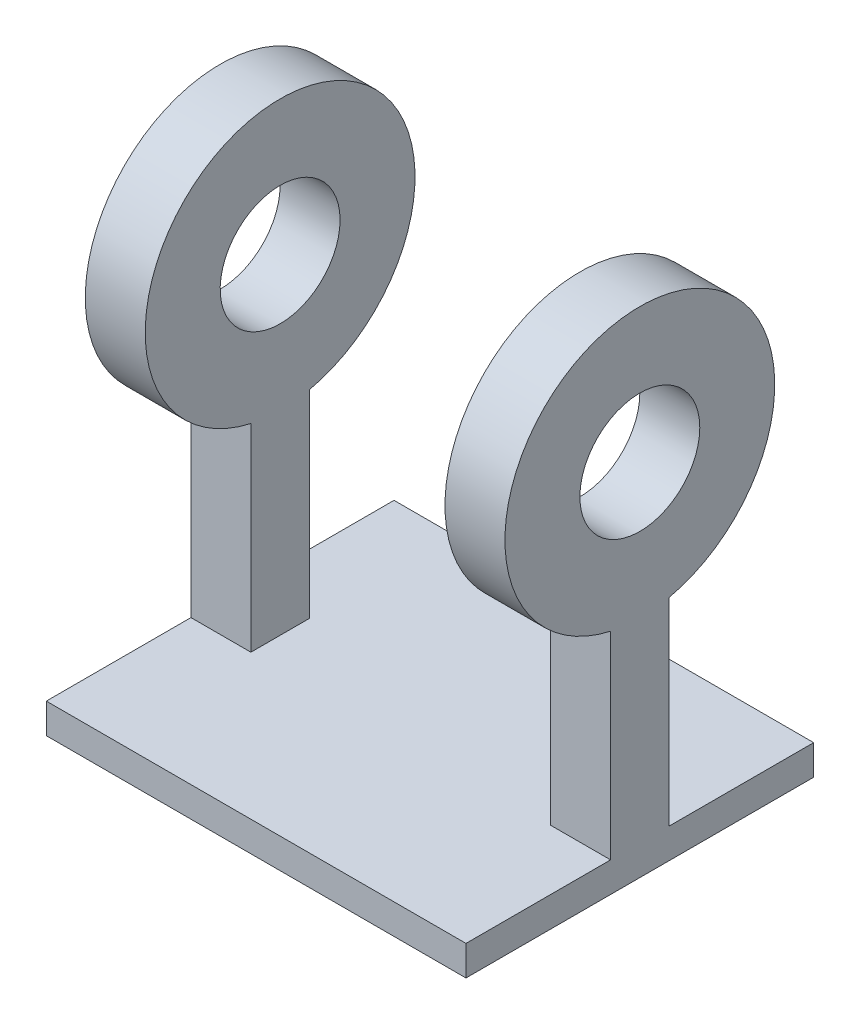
ISO-10303-21;
HEADER;
FILE_DESCRIPTION(('STEP AP214'),'2;1');
FILE_NAME('part.step','',(''),(''),'','','');
FILE_SCHEMA(('AUTOMOTIVE_DESIGN { 1 0 10303 214 1 1 1 1 }'));
ENDSEC;
DATA;
#1=APPLICATION_CONTEXT('core data for automotive mechanical design processes');
#2=APPLICATION_PROTOCOL_DEFINITION('international standard','automotive_design',2000,#1);
#3=PRODUCT_CONTEXT('',#1,'mechanical');
#4=PRODUCT('Part','Part','',(#3));
#5=PRODUCT_RELATED_PRODUCT_CATEGORY('part','',(#4));
#6=PRODUCT_DEFINITION_FORMATION('','',#4);
#7=PRODUCT_DEFINITION_CONTEXT('part definition',#1,'design');
#8=PRODUCT_DEFINITION('design','',#6,#7);
#9=PRODUCT_DEFINITION_SHAPE('','',#8);
#10=(LENGTH_UNIT() NAMED_UNIT(*) SI_UNIT(.MILLI.,.METRE.));
#11=(NAMED_UNIT(*) PLANE_ANGLE_UNIT() SI_UNIT($,.RADIAN.));
#12=(NAMED_UNIT(*) SI_UNIT($,.STERADIAN.) SOLID_ANGLE_UNIT());
#13=UNCERTAINTY_MEASURE_WITH_UNIT(LENGTH_MEASURE(1.E-05),#10,'distance_accuracy_value','');
#14=(GEOMETRIC_REPRESENTATION_CONTEXT(3) GLOBAL_UNCERTAINTY_ASSIGNED_CONTEXT((#13)) GLOBAL_UNIT_ASSIGNED_CONTEXT((#10,
#11,#12)) REPRESENTATION_CONTEXT('',''));
#15=CARTESIAN_POINT('',(0.,0.,0.));
#16=DIRECTION('',(0.,0.,1.));
#17=DIRECTION('',(1.,0.,0.));
#18=AXIS2_PLACEMENT_3D('',#15,#16,#17);
#19=CARTESIAN_POINT('',(0.,55.,4.875));
#20=DIRECTION('',(1.,0.,0.));
#21=DIRECTION('',(0.,0.,-1.));
#22=AXIS2_PLACEMENT_3D('',#19,#20,#21);
#23=CYLINDRICAL_SURFACE('',#22,10.);
#24=CARTESIAN_POINT('',(70.,55.,4.875));
#25=DIRECTION('',(1.,0.,0.));
#26=DIRECTION('',(0.,0.,-1.));
#27=AXIS2_PLACEMENT_3D('',#24,#25,#26);
#28=CIRCLE('',#27,10.);
#29=CARTESIAN_POINT('',(70.,55.,-5.125));
#30=VERTEX_POINT('',#29);
#31=EDGE_CURVE('E235',#30,#30,#28,.T.);
#32=ORIENTED_EDGE('',*,*,#31,.T.);
#33=EDGE_LOOP('',(#32));
#34=FACE_BOUND('',#33,.T.);
#35=CARTESIAN_POINT('',(60.,55.,4.875));
#36=DIRECTION('',(1.,0.,0.));
#37=DIRECTION('',(0.,0.,-1.));
#38=AXIS2_PLACEMENT_3D('',#35,#36,#37);
#39=CIRCLE('',#38,10.);
#40=CARTESIAN_POINT('',(60.,55.,-5.125));
#41=VERTEX_POINT('',#40);
#42=EDGE_CURVE('E42',#41,#41,#39,.F.);
#43=ORIENTED_EDGE('',*,*,#42,.T.);
#44=EDGE_LOOP('',(#43));
#45=FACE_BOUND('',#44,.T.);
#46=ADVANCED_FACE('F33',(#34,#45),#23,.F.);
#47=CARTESIAN_POINT('',(0.,55.,4.875));
#48=DIRECTION('',(1.,0.,0.));
#49=DIRECTION('',(0.,0.,-1.));
#50=AXIS2_PLACEMENT_3D('',#47,#48,#49);
#51=CYLINDRICAL_SURFACE('',#50,22.5);
#52=CARTESIAN_POINT('',(60.,55.,4.875));
#53=DIRECTION('',(1.,0.,0.));
#54=DIRECTION('',(0.,0.,-1.));
#55=AXIS2_PLACEMENT_3D('',#52,#53,#54);
#56=CIRCLE('',#55,22.5);
#57=CARTESIAN_POINT('',(60.,33.0344730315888,9.75));
#58=VERTEX_POINT('',#57);
#59=CARTESIAN_POINT('',(60.,33.0344730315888,0.));
#60=VERTEX_POINT('',#59);
#61=EDGE_CURVE('E269',#58,#60,#56,.F.);
#62=ORIENTED_EDGE('',*,*,#61,.F.);
#63=DIRECTION('',(-1.,0.,0.));
#64=VECTOR('',#63,1.);
#65=CARTESIAN_POINT('',(70.,33.0344730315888,9.75));
#66=LINE('',#65,#64);
#67=CARTESIAN_POINT('',(70.,33.0344730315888,9.75));
#68=VERTEX_POINT('',#67);
#69=EDGE_CURVE('E166',#68,#58,#66,.T.);
#70=ORIENTED_EDGE('',*,*,#69,.F.);
#71=CARTESIAN_POINT('',(70.,55.,4.875));
#72=DIRECTION('',(1.,0.,0.));
#73=DIRECTION('',(0.,0.,-1.));
#74=AXIS2_PLACEMENT_3D('',#71,#72,#73);
#75=CIRCLE('',#74,22.5);
#76=CARTESIAN_POINT('',(70.,33.0344730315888,0.));
#77=VERTEX_POINT('',#76);
#78=EDGE_CURVE('E249',#77,#68,#75,.T.);
#79=ORIENTED_EDGE('',*,*,#78,.F.);
#80=DIRECTION('',(-1.,0.,0.));
#81=VECTOR('',#80,1.);
#82=CARTESIAN_POINT('',(70.,33.0344730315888,0.));
#83=LINE('',#82,#81);
#84=EDGE_CURVE('E162',#77,#60,#83,.T.);
#85=ORIENTED_EDGE('',*,*,#84,.T.);
#86=EDGE_LOOP('',(#62,#70,#79,#85));
#87=FACE_BOUND('',#86,.T.);
#88=ADVANCED_FACE('F191',(#87),#51,.T.);
#89=CARTESIAN_POINT('',(70.,33.0344730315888,0.));
#90=DIRECTION('',(0.,0.,-1.));
#91=DIRECTION('',(-1.,0.,0.));
#92=AXIS2_PLACEMENT_3D('',#89,#90,#91);
#93=PLANE('',#92);
#94=DIRECTION('',(0.,1.,0.));
#95=VECTOR('',#94,1.);
#96=CARTESIAN_POINT('',(10.,33.0344730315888,0.));
#97=LINE('',#96,#95);
#98=CARTESIAN_POINT('',(10.,0.,0.));
#99=VERTEX_POINT('',#98);
#100=CARTESIAN_POINT('',(10.,33.0344730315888,0.));
#101=VERTEX_POINT('',#100);
#102=EDGE_CURVE('E223',#99,#101,#97,.T.);
#103=ORIENTED_EDGE('',*,*,#102,.F.);
#104=DIRECTION('',(-1.,0.,0.));
#105=VECTOR('',#104,1.);
#106=CARTESIAN_POINT('',(70.,0.,0.));
#107=LINE('',#106,#105);
#108=CARTESIAN_POINT('',(0.,0.,0.));
#109=VERTEX_POINT('',#108);
#110=EDGE_CURVE('E141',#99,#109,#107,.T.);
#111=ORIENTED_EDGE('',*,*,#110,.T.);
#112=DIRECTION('',(0.,-1.,0.));
#113=VECTOR('',#112,1.);
#114=CARTESIAN_POINT('',(0.,33.0344730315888,0.));
#115=LINE('',#114,#113);
#116=CARTESIAN_POINT('',(0.,33.0344730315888,0.));
#117=VERTEX_POINT('',#116);
#118=EDGE_CURVE('E142',#117,#109,#115,.T.);
#119=ORIENTED_EDGE('',*,*,#118,.F.);
#120=EDGE_CURVE('E165',#101,#117,#83,.T.);
#121=ORIENTED_EDGE('',*,*,#120,.F.);
#122=EDGE_LOOP('',(#103,#111,#119,#121));
#123=FACE_BOUND('',#122,.T.);
#124=ADVANCED_FACE('F198',(#123),#93,.T.);
#125=CARTESIAN_POINT('',(70.,0.,9.75));
#126=DIRECTION('',(0.,0.,1.));
#127=DIRECTION('',(1.,0.,0.));
#128=AXIS2_PLACEMENT_3D('',#125,#126,#127);
#129=PLANE('',#128);
#130=DIRECTION('',(0.,-1.,0.));
#131=VECTOR('',#130,1.);
#132=CARTESIAN_POINT('',(10.,0.,9.75));
#133=LINE('',#132,#131);
#134=CARTESIAN_POINT('',(10.,33.0344730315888,9.75));
#135=VERTEX_POINT('',#134);
#136=CARTESIAN_POINT('',(10.,0.,9.75));
#137=VERTEX_POINT('',#136);
#138=EDGE_CURVE('E300',#135,#137,#133,.T.);
#139=ORIENTED_EDGE('',*,*,#138,.F.);
#140=CARTESIAN_POINT('',(0.,33.0344730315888,9.75));
#141=VERTEX_POINT('',#140);
#142=EDGE_CURVE('E85',#135,#141,#66,.T.);
#143=ORIENTED_EDGE('',*,*,#142,.T.);
#144=DIRECTION('',(0.,1.,0.));
#145=VECTOR('',#144,1.);
#146=CARTESIAN_POINT('',(0.,0.,9.75));
#147=LINE('',#146,#145);
#148=CARTESIAN_POINT('',(0.,0.,9.75));
#149=VERTEX_POINT('',#148);
#150=EDGE_CURVE('E158',#149,#141,#147,.T.);
#151=ORIENTED_EDGE('',*,*,#150,.F.);
#152=DIRECTION('',(-1.,0.,0.));
#153=VECTOR('',#152,1.);
#154=CARTESIAN_POINT('',(70.,0.,9.75));
#155=LINE('',#154,#153);
#156=EDGE_CURVE('E78',#137,#149,#155,.T.);
#157=ORIENTED_EDGE('',*,*,#156,.F.);
#158=EDGE_LOOP('',(#139,#143,#151,#157));
#159=FACE_BOUND('',#158,.T.);
#160=ADVANCED_FACE('F203',(#159),#129,.T.);
#161=CARTESIAN_POINT('',(0.,55.,4.875));
#162=DIRECTION('',(1.,0.,0.));
#163=DIRECTION('',(0.,0.,-1.));
#164=AXIS2_PLACEMENT_3D('',#161,#162,#163);
#165=CIRCLE('',#164,10.);
#166=CARTESIAN_POINT('',(0.,55.,-5.125));
#167=VERTEX_POINT('',#166);
#168=EDGE_CURVE('E215',#167,#167,#165,.T.);
#169=ORIENTED_EDGE('',*,*,#168,.F.);
#170=EDGE_LOOP('',(#169));
#171=FACE_BOUND('',#170,.T.);
#172=CARTESIAN_POINT('',(10.,55.,4.875));
#173=DIRECTION('',(-1.,0.,0.));
#174=DIRECTION('',(0.,-1.,0.));
#175=AXIS2_PLACEMENT_3D('',#172,#173,#174);
#176=CIRCLE('',#175,10.);
#177=CARTESIAN_POINT('',(10.,45.,4.875));
#178=VERTEX_POINT('',#177);
#179=EDGE_CURVE('E11',#178,#178,#176,.F.);
#180=ORIENTED_EDGE('',*,*,#179,.T.);
#181=EDGE_LOOP('',(#180));
#182=FACE_BOUND('',#181,.T.);
#183=ADVANCED_FACE('F194',(#171,#182),#23,.F.);
#184=DIRECTION('',(0.,-1.,0.));
#185=VECTOR('',#184,1.);
#186=CARTESIAN_POINT('',(60.,33.0344730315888,0.));
#187=LINE('',#186,#185);
#188=CARTESIAN_POINT('',(60.,0.,0.));
#189=VERTEX_POINT('',#188);
#190=EDGE_CURVE('E240',#60,#189,#187,.T.);
#191=ORIENTED_EDGE('',*,*,#190,.F.);
#192=ORIENTED_EDGE('',*,*,#84,.F.);
#193=DIRECTION('',(0.,-1.,0.));
#194=VECTOR('',#193,1.);
#195=CARTESIAN_POINT('',(70.,33.0344730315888,0.));
#196=LINE('',#195,#194);
#197=CARTESIAN_POINT('',(70.,0.,0.));
#198=VERTEX_POINT('',#197);
#199=EDGE_CURVE('E161',#77,#198,#196,.T.);
#200=ORIENTED_EDGE('',*,*,#199,.T.);
#201=EDGE_CURVE('E93',#198,#189,#107,.T.);
#202=ORIENTED_EDGE('',*,*,#201,.T.);
#203=EDGE_LOOP('',(#191,#192,#200,#202));
#204=FACE_BOUND('',#203,.T.);
#205=ADVANCED_FACE('F35',(#204),#93,.T.);
#206=DIRECTION('',(0.,1.,0.));
#207=VECTOR('',#206,1.);
#208=CARTESIAN_POINT('',(60.,0.,9.75));
#209=LINE('',#208,#207);
#210=CARTESIAN_POINT('',(60.,0.,9.75));
#211=VERTEX_POINT('',#210);
#212=EDGE_CURVE('E275',#211,#58,#209,.T.);
#213=ORIENTED_EDGE('',*,*,#212,.F.);
#214=CARTESIAN_POINT('',(70.,0.,9.75));
#215=VERTEX_POINT('',#214);
#216=EDGE_CURVE('E50',#215,#211,#155,.T.);
#217=ORIENTED_EDGE('',*,*,#216,.F.);
#218=DIRECTION('',(0.,1.,0.));
#219=VECTOR('',#218,1.);
#220=CARTESIAN_POINT('',(70.,0.,9.75));
#221=LINE('',#220,#219);
#222=EDGE_CURVE('E139',#215,#68,#221,.T.);
#223=ORIENTED_EDGE('',*,*,#222,.T.);
#224=ORIENTED_EDGE('',*,*,#69,.T.);
#225=EDGE_LOOP('',(#213,#217,#223,#224));
#226=FACE_BOUND('',#225,.T.);
#227=ADVANCED_FACE('F209',(#226),#129,.T.);
#228=CARTESIAN_POINT('',(70.,0.,33.875));
#229=DIRECTION('',(0.,1.,0.));
#230=DIRECTION('',(0.,0.,1.));
#231=AXIS2_PLACEMENT_3D('',#228,#229,#230);
#232=PLANE('',#231);
#233=DIRECTION('',(0.,0.,-1.));
#234=VECTOR('',#233,1.);
#235=CARTESIAN_POINT('',(0.,0.,33.875));
#236=LINE('',#235,#234);
#237=CARTESIAN_POINT('',(0.,0.,33.875));
#238=VERTEX_POINT('',#237);
#239=EDGE_CURVE('E155',#238,#149,#236,.T.);
#240=ORIENTED_EDGE('',*,*,#239,.F.);
#241=DIRECTION('',(-1.,0.,0.));
#242=VECTOR('',#241,1.);
#243=CARTESIAN_POINT('',(70.,0.,33.875));
#244=LINE('',#243,#242);
#245=CARTESIAN_POINT('',(70.,0.,33.875));
#246=VERTEX_POINT('',#245);
#247=EDGE_CURVE('E116',#246,#238,#244,.T.);
#248=ORIENTED_EDGE('',*,*,#247,.F.);
#249=DIRECTION('',(0.,0.,-1.));
#250=VECTOR('',#249,1.);
#251=CARTESIAN_POINT('',(70.,0.,33.875));
#252=LINE('',#251,#250);
#253=EDGE_CURVE('E129',#246,#215,#252,.T.);
#254=ORIENTED_EDGE('',*,*,#253,.T.);
#255=ORIENTED_EDGE('',*,*,#216,.T.);
#256=DIRECTION('',(0.,0.,1.));
#257=VECTOR('',#256,1.);
#258=CARTESIAN_POINT('',(60.,0.,-33.25));
#259=LINE('',#258,#257);
#260=EDGE_CURVE('E294',#189,#211,#259,.T.);
#261=ORIENTED_EDGE('',*,*,#260,.F.);
#262=ORIENTED_EDGE('',*,*,#201,.F.);
#263=DIRECTION('',(0.,0.,-1.));
#264=VECTOR('',#263,1.);
#265=CARTESIAN_POINT('',(70.,0.,0.));
#266=LINE('',#265,#264);
#267=CARTESIAN_POINT('',(70.,0.,-24.125));
#268=VERTEX_POINT('',#267);
#269=EDGE_CURVE('E134',#198,#268,#266,.T.);
#270=ORIENTED_EDGE('',*,*,#269,.T.);
#271=DIRECTION('',(-1.,0.,0.));
#272=VECTOR('',#271,1.);
#273=CARTESIAN_POINT('',(70.,0.,-24.125));
#274=LINE('',#273,#272);
#275=CARTESIAN_POINT('',(0.,0.,-24.125));
#276=VERTEX_POINT('',#275);
#277=EDGE_CURVE('E172',#268,#276,#274,.T.);
#278=ORIENTED_EDGE('',*,*,#277,.T.);
#279=DIRECTION('',(0.,0.,-1.));
#280=VECTOR('',#279,1.);
#281=CARTESIAN_POINT('',(0.,0.,0.));
#282=LINE('',#281,#280);
#283=EDGE_CURVE('E145',#109,#276,#282,.T.);
#284=ORIENTED_EDGE('',*,*,#283,.F.);
#285=ORIENTED_EDGE('',*,*,#110,.F.);
#286=DIRECTION('',(0.,0.,1.));
#287=VECTOR('',#286,1.);
#288=CARTESIAN_POINT('',(10.,0.,-33.25));
#289=LINE('',#288,#287);
#290=EDGE_CURVE('E229',#99,#137,#289,.T.);
#291=ORIENTED_EDGE('',*,*,#290,.T.);
#292=ORIENTED_EDGE('',*,*,#156,.T.);
#293=EDGE_LOOP('',(#240,#248,#254,#255,#261,#262,#270,#278,#284,#285,#291,#292));
#294=FACE_BOUND('',#293,.T.);
#295=ADVANCED_FACE('F257',(#294),#232,.T.);
#296=CARTESIAN_POINT('',(70.,-5.,33.875));
#297=DIRECTION('',(0.,0.,1.));
#298=DIRECTION('',(1.,0.,0.));
#299=AXIS2_PLACEMENT_3D('',#296,#297,#298);
#300=PLANE('',#299);
#301=DIRECTION('',(0.,1.,0.));
#302=VECTOR('',#301,1.);
#303=CARTESIAN_POINT('',(0.,-5.,33.875));
#304=LINE('',#303,#302);
#305=CARTESIAN_POINT('',(0.,-5.,33.875));
#306=VERTEX_POINT('',#305);
#307=EDGE_CURVE('E111',#306,#238,#304,.T.);
#308=ORIENTED_EDGE('',*,*,#307,.F.);
#309=DIRECTION('',(-1.,0.,0.));
#310=VECTOR('',#309,1.);
#311=CARTESIAN_POINT('',(70.,-5.,33.875));
#312=LINE('',#311,#310);
#313=CARTESIAN_POINT('',(70.,-5.,33.875));
#314=VERTEX_POINT('',#313);
#315=EDGE_CURVE('E106',#314,#306,#312,.T.);
#316=ORIENTED_EDGE('',*,*,#315,.F.);
#317=DIRECTION('',(0.,1.,0.));
#318=VECTOR('',#317,1.);
#319=CARTESIAN_POINT('',(70.,-5.,33.875));
#320=LINE('',#319,#318);
#321=EDGE_CURVE('E109',#314,#246,#320,.T.);
#322=ORIENTED_EDGE('',*,*,#321,.T.);
#323=ORIENTED_EDGE('',*,*,#247,.T.);
#324=EDGE_LOOP('',(#308,#316,#322,#323));
#325=FACE_BOUND('',#324,.T.);
#326=ADVANCED_FACE('F108',(#325),#300,.T.);
#327=CARTESIAN_POINT('',(70.,-4.99999999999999,-24.125));
#328=DIRECTION('',(0.,-1.,0.));
#329=DIRECTION('',(0.,0.,-1.));
#330=AXIS2_PLACEMENT_3D('',#327,#328,#329);
#331=PLANE('',#330);
#332=DIRECTION('',(0.,0.,1.));
#333=VECTOR('',#332,1.);
#334=CARTESIAN_POINT('',(0.,-4.99999999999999,-24.125));
#335=LINE('',#334,#333);
#336=CARTESIAN_POINT('',(0.,-4.99999999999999,-24.125));
#337=VERTEX_POINT('',#336);
#338=EDGE_CURVE('E152',#337,#306,#335,.T.);
#339=ORIENTED_EDGE('',*,*,#338,.F.);
#340=DIRECTION('',(-1.,0.,0.));
#341=VECTOR('',#340,1.);
#342=CARTESIAN_POINT('',(70.,-4.99999999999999,-24.125));
#343=LINE('',#342,#341);
#344=CARTESIAN_POINT('',(70.,-4.99999999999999,-24.125));
#345=VERTEX_POINT('',#344);
#346=EDGE_CURVE('E117',#345,#337,#343,.T.);
#347=ORIENTED_EDGE('',*,*,#346,.F.);
#348=DIRECTION('',(0.,0.,1.));
#349=VECTOR('',#348,1.);
#350=CARTESIAN_POINT('',(70.,-4.99999999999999,-24.125));
#351=LINE('',#350,#349);
#352=EDGE_CURVE('E126',#345,#314,#351,.T.);
#353=ORIENTED_EDGE('',*,*,#352,.T.);
#354=ORIENTED_EDGE('',*,*,#315,.T.);
#355=EDGE_LOOP('',(#339,#347,#353,#354));
#356=FACE_BOUND('',#355,.T.);
#357=ADVANCED_FACE('F131',(#356),#331,.T.);
#358=CARTESIAN_POINT('',(70.,0.,-24.125));
#359=DIRECTION('',(0.,0.,-1.));
#360=DIRECTION('',(-1.,0.,0.));
#361=AXIS2_PLACEMENT_3D('',#358,#359,#360);
#362=PLANE('',#361);
#363=DIRECTION('',(0.,-1.,0.));
#364=VECTOR('',#363,1.);
#365=CARTESIAN_POINT('',(0.,0.,-24.125));
#366=LINE('',#365,#364);
#367=EDGE_CURVE('E149',#276,#337,#366,.T.);
#368=ORIENTED_EDGE('',*,*,#367,.F.);
#369=ORIENTED_EDGE('',*,*,#277,.F.);
#370=DIRECTION('',(0.,-1.,0.));
#371=VECTOR('',#370,1.);
#372=CARTESIAN_POINT('',(70.,0.,-24.125));
#373=LINE('',#372,#371);
#374=EDGE_CURVE('E132',#268,#345,#373,.T.);
#375=ORIENTED_EDGE('',*,*,#374,.T.);
#376=ORIENTED_EDGE('',*,*,#346,.T.);
#377=EDGE_LOOP('',(#368,#369,#375,#376));
#378=FACE_BOUND('',#377,.T.);
#379=ADVANCED_FACE('F287',(#378),#362,.T.);
#380=CARTESIAN_POINT('',(70.,0.,0.));
#381=DIRECTION('',(1.,0.,0.));
#382=DIRECTION('',(0.,0.,-1.));
#383=AXIS2_PLACEMENT_3D('',#380,#381,#382);
#384=PLANE('',#383);
#385=ORIENTED_EDGE('',*,*,#199,.F.);
#386=ORIENTED_EDGE('',*,*,#78,.T.);
#387=ORIENTED_EDGE('',*,*,#222,.F.);
#388=ORIENTED_EDGE('',*,*,#253,.F.);
#389=ORIENTED_EDGE('',*,*,#321,.F.);
#390=ORIENTED_EDGE('',*,*,#352,.F.);
#391=ORIENTED_EDGE('',*,*,#374,.F.);
#392=ORIENTED_EDGE('',*,*,#269,.F.);
#393=EDGE_LOOP('',(#385,#386,#387,#388,#389,#390,#391,#392));
#394=FACE_BOUND('',#393,.T.);
#395=ORIENTED_EDGE('',*,*,#31,.F.);
#396=EDGE_LOOP('',(#395));
#397=FACE_BOUND('',#396,.T.);
#398=ADVANCED_FACE('F123',(#394,#397),#384,.T.);
#399=CARTESIAN_POINT('',(0.,0.,0.));
#400=DIRECTION('',(1.,0.,0.));
#401=DIRECTION('',(0.,0.,-1.));
#402=AXIS2_PLACEMENT_3D('',#399,#400,#401);
#403=PLANE('',#402);
#404=ORIENTED_EDGE('',*,*,#150,.T.);
#405=CARTESIAN_POINT('',(0.,55.,4.875));
#406=DIRECTION('',(1.,0.,0.));
#407=DIRECTION('',(0.,0.,-1.));
#408=AXIS2_PLACEMENT_3D('',#405,#406,#407);
#409=CIRCLE('',#408,22.5);
#410=EDGE_CURVE('E146',#117,#141,#409,.T.);
#411=ORIENTED_EDGE('',*,*,#410,.F.);
#412=ORIENTED_EDGE('',*,*,#118,.T.);
#413=ORIENTED_EDGE('',*,*,#283,.T.);
#414=ORIENTED_EDGE('',*,*,#367,.T.);
#415=ORIENTED_EDGE('',*,*,#338,.T.);
#416=ORIENTED_EDGE('',*,*,#307,.T.);
#417=ORIENTED_EDGE('',*,*,#239,.T.);
#418=EDGE_LOOP('',(#404,#411,#412,#413,#414,#415,#416,#417));
#419=FACE_BOUND('',#418,.T.);
#420=ORIENTED_EDGE('',*,*,#168,.T.);
#421=EDGE_LOOP('',(#420));
#422=FACE_BOUND('',#421,.T.);
#423=ADVANCED_FACE('F247',(#419,#422),#403,.F.);
#424=ORIENTED_EDGE('',*,*,#142,.F.);
#425=CARTESIAN_POINT('',(10.,55.,4.875));
#426=DIRECTION('',(-1.,0.,0.));
#427=DIRECTION('',(0.,-1.,0.));
#428=AXIS2_PLACEMENT_3D('',#425,#426,#427);
#429=CIRCLE('',#428,22.5);
#430=EDGE_CURVE('E227',#101,#135,#429,.F.);
#431=ORIENTED_EDGE('',*,*,#430,.F.);
#432=ORIENTED_EDGE('',*,*,#120,.T.);
#433=ORIENTED_EDGE('',*,*,#410,.T.);
#434=EDGE_LOOP('',(#424,#431,#432,#433));
#435=FACE_BOUND('',#434,.T.);
#436=ADVANCED_FACE('F186',(#435),#51,.T.);
#437=CARTESIAN_POINT('',(10.,0.,-33.25));
#438=DIRECTION('',(-1.,0.,0.));
#439=DIRECTION('',(0.,-1.,0.));
#440=AXIS2_PLACEMENT_3D('',#437,#438,#439);
#441=PLANE('',#440);
#442=ORIENTED_EDGE('',*,*,#179,.F.);
#443=EDGE_LOOP('',(#442));
#444=FACE_BOUND('',#443,.T.);
#445=ORIENTED_EDGE('',*,*,#102,.T.);
#446=ORIENTED_EDGE('',*,*,#430,.T.);
#447=ORIENTED_EDGE('',*,*,#138,.T.);
#448=ORIENTED_EDGE('',*,*,#290,.F.);
#449=EDGE_LOOP('',(#445,#446,#447,#448));
#450=FACE_BOUND('',#449,.T.);
#451=ADVANCED_FACE('F180',(#444,#450),#441,.F.);
#452=CARTESIAN_POINT('',(60.,0.,-33.25));
#453=DIRECTION('',(1.,0.,0.));
#454=DIRECTION('',(0.,0.,-1.));
#455=AXIS2_PLACEMENT_3D('',#452,#453,#454);
#456=PLANE('',#455);
#457=ORIENTED_EDGE('',*,*,#212,.T.);
#458=ORIENTED_EDGE('',*,*,#61,.T.);
#459=ORIENTED_EDGE('',*,*,#190,.T.);
#460=ORIENTED_EDGE('',*,*,#260,.T.);
#461=EDGE_LOOP('',(#457,#458,#459,#460));
#462=FACE_BOUND('',#461,.T.);
#463=ORIENTED_EDGE('',*,*,#42,.F.);
#464=EDGE_LOOP('',(#463));
#465=FACE_BOUND('',#464,.T.);
#466=ADVANCED_FACE('F178',(#462,#465),#456,.F.);
#467=CLOSED_SHELL('',(#46,#88,#124,#160,#183,#205,#227,#295,#326,#357,#379,#398,#423,#436,#451,#466));
#468=MANIFOLD_SOLID_BREP('B2',#467);
#469=ADVANCED_BREP_SHAPE_REPRESENTATION('',(#18,#468),#14);
#470=SHAPE_DEFINITION_REPRESENTATION(#9,#469);
ENDSEC;
END-ISO-10303-21;
